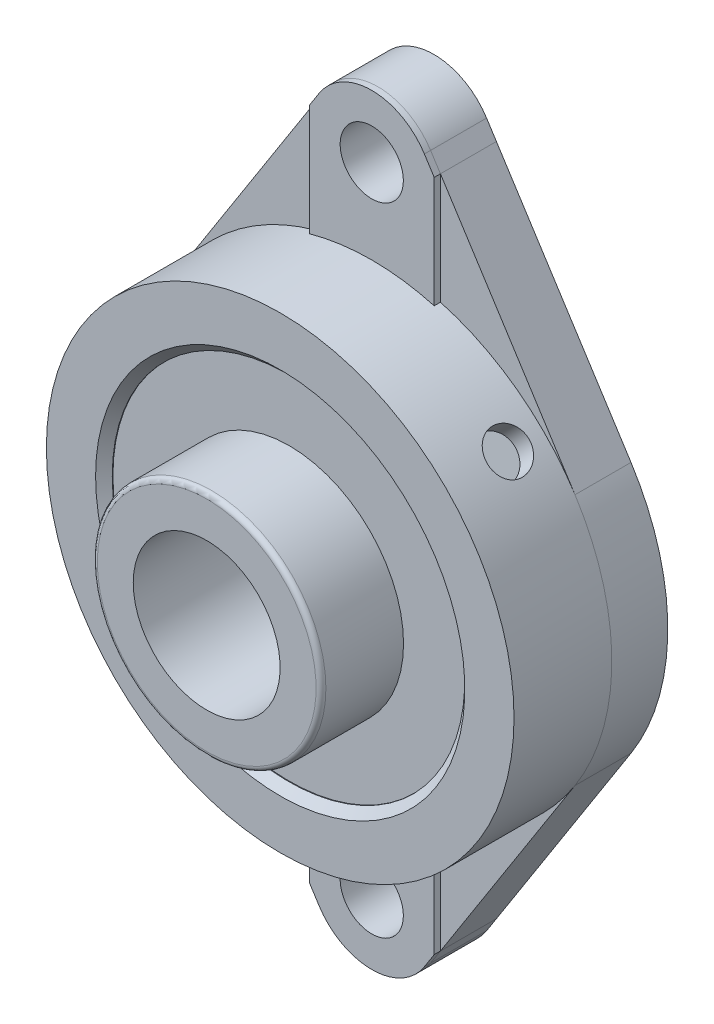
ISO-10303-21;
HEADER;
FILE_DESCRIPTION(('STEP AP214'),'2;1');
FILE_NAME('part.step','',(''),(''),'','','');
FILE_SCHEMA(('AUTOMOTIVE_DESIGN { 1 0 10303 214 1 1 1 1 }'));
ENDSEC;
DATA;
#1=APPLICATION_CONTEXT('core data for automotive mechanical design processes');
#2=APPLICATION_PROTOCOL_DEFINITION('international standard','automotive_design',2000,#1);
#3=PRODUCT_CONTEXT('',#1,'mechanical');
#4=PRODUCT('Part','Part','',(#3));
#5=PRODUCT_RELATED_PRODUCT_CATEGORY('part','',(#4));
#6=PRODUCT_DEFINITION_FORMATION('','',#4);
#7=PRODUCT_DEFINITION_CONTEXT('part definition',#1,'design');
#8=PRODUCT_DEFINITION('design','',#6,#7);
#9=PRODUCT_DEFINITION_SHAPE('','',#8);
#10=(LENGTH_UNIT() NAMED_UNIT(*) SI_UNIT(.MILLI.,.METRE.));
#11=(NAMED_UNIT(*) PLANE_ANGLE_UNIT() SI_UNIT($,.RADIAN.));
#12=(NAMED_UNIT(*) SI_UNIT($,.STERADIAN.) SOLID_ANGLE_UNIT());
#13=UNCERTAINTY_MEASURE_WITH_UNIT(LENGTH_MEASURE(1.E-05),#10,'distance_accuracy_value','');
#14=(GEOMETRIC_REPRESENTATION_CONTEXT(3) GLOBAL_UNCERTAINTY_ASSIGNED_CONTEXT((#13)) GLOBAL_UNIT_ASSIGNED_CONTEXT((#10,
#11,#12)) REPRESENTATION_CONTEXT('',''));
#15=CARTESIAN_POINT('',(0.,0.,0.));
#16=DIRECTION('',(0.,0.,1.));
#17=DIRECTION('',(1.,0.,0.));
#18=AXIS2_PLACEMENT_3D('',#15,#16,#17);
#19=CARTESIAN_POINT('',(0.,0.,0.));
#20=DIRECTION('',(0.,0.,-1.));
#21=DIRECTION('',(-1.,0.,0.));
#22=AXIS2_PLACEMENT_3D('',#19,#20,#21);
#23=CYLINDRICAL_SURFACE('',#22,36.);
#24=CARTESIAN_POINT('',(0.,0.,29.7));
#25=DIRECTION('',(0.,0.,-1.));
#26=DIRECTION('',(-1.,0.,0.));
#27=AXIS2_PLACEMENT_3D('',#24,#25,#26);
#28=CIRCLE('',#27,36.);
#29=CARTESIAN_POINT('',(-36.,0.,29.7));
#30=VERTEX_POINT('',#29);
#31=EDGE_CURVE('E313',#30,#30,#28,.T.);
#32=ORIENTED_EDGE('',*,*,#31,.F.);
#33=EDGE_LOOP('',(#32));
#34=FACE_BOUND('',#33,.T.);
#35=CARTESIAN_POINT('',(0.,0.,29.56));
#36=DIRECTION('',(0.,0.,-1.));
#37=DIRECTION('',(-1.,0.,0.));
#38=AXIS2_PLACEMENT_3D('',#35,#36,#37);
#39=CIRCLE('',#38,36.);
#40=CARTESIAN_POINT('',(-36.,0.,29.56));
#41=VERTEX_POINT('',#40);
#42=EDGE_CURVE('E11',#41,#41,#39,.F.);
#43=ORIENTED_EDGE('',*,*,#42,.F.);
#44=EDGE_LOOP('',(#43));
#45=FACE_BOUND('',#44,.T.);
#46=ADVANCED_FACE('F31',(#34,#45),#23,.F.);
#47=CARTESIAN_POINT('',(0.,0.,1.7));
#48=DIRECTION('',(0.,0.,-1.));
#49=DIRECTION('',(-1.,0.,0.));
#50=AXIS2_PLACEMENT_3D('',#47,#48,#49);
#51=CIRCLE('',#50,36.);
#52=CARTESIAN_POINT('',(-36.,0.,1.7));
#53=VERTEX_POINT('',#52);
#54=EDGE_CURVE('E202',#53,#53,#51,.T.);
#55=ORIENTED_EDGE('',*,*,#54,.T.);
#56=EDGE_LOOP('',(#55));
#57=FACE_BOUND('',#56,.T.);
#58=CARTESIAN_POINT('',(0.,0.,12.56));
#59=DIRECTION('',(0.,0.,1.));
#60=DIRECTION('',(1.,0.,0.));
#61=AXIS2_PLACEMENT_3D('',#58,#59,#60);
#62=CIRCLE('',#61,36.);
#63=CARTESIAN_POINT('',(36.,0.,12.56));
#64=VERTEX_POINT('',#63);
#65=EDGE_CURVE('E39',#64,#64,#62,.F.);
#66=ORIENTED_EDGE('',*,*,#65,.F.);
#67=EDGE_LOOP('',(#66));
#68=FACE_BOUND('',#67,.T.);
#69=ADVANCED_FACE('F291',(#57,#68),#23,.F.);
#70=CARTESIAN_POINT('',(0.,0.,0.));
#71=DIRECTION('',(0.,0.,1.));
#72=DIRECTION('',(1.,0.,0.));
#73=AXIS2_PLACEMENT_3D('',#70,#71,#72);
#74=PLANE('',#73);
#75=DIRECTION('',(0.,1.,0.));
#76=VECTOR('',#75,1.);
#77=CARTESIAN_POINT('',(12.75,0.,0.));
#78=LINE('',#77,#76);
#79=CARTESIAN_POINT('',(12.75,35.4785498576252,0.));
#80=VERTEX_POINT('',#79);
#81=CARTESIAN_POINT('',(12.75,46.0163014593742,0.));
#82=VERTEX_POINT('',#81);
#83=EDGE_CURVE('E201',#80,#82,#78,.T.);
#84=ORIENTED_EDGE('',*,*,#83,.F.);
#85=CARTESIAN_POINT('',(0.,0.,0.));
#86=DIRECTION('',(0.,0.,-1.));
#87=DIRECTION('',(-1.,0.,0.));
#88=AXIS2_PLACEMENT_3D('',#85,#86,#87);
#89=CIRCLE('',#88,37.7);
#90=CARTESIAN_POINT('',(-12.75,35.4785498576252,0.));
#91=VERTEX_POINT('',#90);
#92=EDGE_CURVE('E46',#91,#80,#89,.T.);
#93=ORIENTED_EDGE('',*,*,#92,.F.);
#94=DIRECTION('',(0.,-1.,0.));
#95=VECTOR('',#94,1.);
#96=CARTESIAN_POINT('',(-12.75,0.,0.));
#97=LINE('',#96,#95);
#98=CARTESIAN_POINT('',(-12.75,46.0163014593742,0.));
#99=VERTEX_POINT('',#98);
#100=EDGE_CURVE('E53',#99,#91,#97,.T.);
#101=ORIENTED_EDGE('',*,*,#100,.F.);
#102=CARTESIAN_POINT('',(0.,0.,0.));
#103=DIRECTION('',(0.,0.,1.));
#104=DIRECTION('',(1.,0.,0.));
#105=AXIS2_PLACEMENT_3D('',#102,#103,#104);
#106=CIRCLE('',#105,47.75);
#107=EDGE_CURVE('E528',#82,#99,#106,.T.);
#108=ORIENTED_EDGE('',*,*,#107,.F.);
#109=EDGE_LOOP('',(#84,#93,#101,#108));
#110=FACE_BOUND('',#109,.T.);
#111=ADVANCED_FACE('F200',(#110),#74,.F.);
#112=CARTESIAN_POINT('',(0.,0.,11.43));
#113=DIRECTION('',(0.,0.,1.));
#114=DIRECTION('',(1.,0.,0.));
#115=AXIS2_PLACEMENT_3D('',#112,#113,#114);
#116=PLANE('',#115);
#117=DIRECTION('',(0.,-1.,0.));
#118=VECTOR('',#117,1.);
#119=CARTESIAN_POINT('',(-12.75,0.,11.43));
#120=LINE('',#119,#118);
#121=CARTESIAN_POINT('',(-12.75,68.7258211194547,11.43));
#122=VERTEX_POINT('',#121);
#123=CARTESIAN_POINT('',(-12.75,46.0163014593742,11.43));
#124=VERTEX_POINT('',#123);
#125=EDGE_CURVE('E376',#122,#124,#120,.T.);
#126=ORIENTED_EDGE('',*,*,#125,.F.);
#127=DIRECTION('',(-0.538461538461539,-0.842650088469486,0.));
#128=VECTOR('',#127,1.);
#129=CARTESIAN_POINT('',(-10.7437886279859,71.8653846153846,11.43));
#130=LINE('',#129,#128);
#131=CARTESIAN_POINT('',(-40.236541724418,25.7115384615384,11.43));
#132=VERTEX_POINT('',#131);
#133=EDGE_CURVE('E423',#122,#132,#130,.T.);
#134=ORIENTED_EDGE('',*,*,#133,.T.);
#135=CARTESIAN_POINT('',(0.,0.,11.43));
#136=DIRECTION('',(0.,0.,1.));
#137=DIRECTION('',(1.,0.,0.));
#138=AXIS2_PLACEMENT_3D('',#135,#136,#137);
#139=CIRCLE('',#138,47.75);
#140=EDGE_CURVE('E390',#124,#132,#139,.T.);
#141=ORIENTED_EDGE('',*,*,#140,.F.);
#142=EDGE_LOOP('',(#126,#134,#141));
#143=FACE_BOUND('',#142,.T.);
#144=ADVANCED_FACE('F580',(#143),#116,.T.);
#145=CARTESIAN_POINT('',(-12.75,-35.4785498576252,0.));
#146=VERTEX_POINT('',#145);
#147=CARTESIAN_POINT('',(-12.75,-46.0163014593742,0.));
#148=VERTEX_POINT('',#147);
#149=EDGE_CURVE('E209',#146,#148,#97,.T.);
#150=ORIENTED_EDGE('',*,*,#149,.F.);
#151=CARTESIAN_POINT('',(12.75,-35.4785498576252,0.));
#152=VERTEX_POINT('',#151);
#153=EDGE_CURVE('E194',#152,#146,#89,.T.);
#154=ORIENTED_EDGE('',*,*,#153,.F.);
#155=CARTESIAN_POINT('',(12.75,-46.0163014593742,0.));
#156=VERTEX_POINT('',#155);
#157=EDGE_CURVE('E212',#156,#152,#78,.T.);
#158=ORIENTED_EDGE('',*,*,#157,.F.);
#159=EDGE_CURVE('E471',#148,#156,#106,.T.);
#160=ORIENTED_EDGE('',*,*,#159,.F.);
#161=EDGE_LOOP('',(#150,#154,#158,#160));
#162=FACE_BOUND('',#161,.T.);
#163=ADVANCED_FACE('F520',(#162),#74,.F.);
#164=ORIENTED_EDGE('',*,*,#100,.T.);
#165=EDGE_CURVE('E191',#146,#91,#89,.T.);
#166=ORIENTED_EDGE('',*,*,#165,.F.);
#167=ORIENTED_EDGE('',*,*,#149,.T.);
#168=CARTESIAN_POINT('',(-40.2365417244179,-25.7115384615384,0.));
#169=VERTEX_POINT('',#168);
#170=EDGE_CURVE('E468',#169,#148,#106,.T.);
#171=ORIENTED_EDGE('',*,*,#170,.F.);
#172=CARTESIAN_POINT('',(0.,0.,0.));
#173=DIRECTION('',(0.,0.,1.));
#174=DIRECTION('',(0.,1.,0.));
#175=AXIS2_PLACEMENT_3D('',#172,#173,#174);
#176=CIRCLE('',#175,47.75);
#177=CARTESIAN_POINT('',(-40.236541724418,25.7115384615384,0.));
#178=VERTEX_POINT('',#177);
#179=EDGE_CURVE('E392',#178,#169,#176,.T.);
#180=ORIENTED_EDGE('',*,*,#179,.F.);
#181=EDGE_CURVE('E206',#99,#178,#106,.T.);
#182=ORIENTED_EDGE('',*,*,#181,.F.);
#183=EDGE_LOOP('',(#164,#166,#167,#171,#180,#182));
#184=FACE_BOUND('',#183,.T.);
#185=ADVANCED_FACE('F204',(#184),#74,.F.);
#186=CARTESIAN_POINT('',(0.,65.,0.));
#187=DIRECTION('',(0.,0.,1.));
#188=DIRECTION('',(1.,0.,0.));
#189=AXIS2_PLACEMENT_3D('',#186,#187,#188);
#190=CIRCLE('',#189,6.45);
#191=CARTESIAN_POINT('',(6.45,65.,0.));
#192=VERTEX_POINT('',#191);
#193=EDGE_CURVE('E197',#192,#192,#190,.T.);
#194=ORIENTED_EDGE('',*,*,#193,.T.);
#195=EDGE_LOOP('',(#194));
#196=FACE_BOUND('',#195,.T.);
#197=DIRECTION('',(0.,-1.,0.));
#198=VECTOR('',#197,1.);
#199=CARTESIAN_POINT('',(-12.75,0.,0.));
#200=LINE('',#199,#198);
#201=CARTESIAN_POINT('',(-12.75,68.7258211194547,0.));
#202=VERTEX_POINT('',#201);
#203=EDGE_CURVE('E506',#202,#99,#200,.T.);
#204=ORIENTED_EDGE('',*,*,#203,.F.);
#205=DIRECTION('',(-0.538461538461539,-0.842650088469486,0.));
#206=VECTOR('',#205,1.);
#207=CARTESIAN_POINT('',(-10.7437886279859,71.8653846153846,0.));
#208=LINE('',#207,#206);
#209=CARTESIAN_POINT('',(-10.7437886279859,71.8653846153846,0.));
#210=VERTEX_POINT('',#209);
#211=EDGE_CURVE('E397',#210,#202,#208,.T.);
#212=ORIENTED_EDGE('',*,*,#211,.F.);
#213=CARTESIAN_POINT('',(0.,65.,0.));
#214=DIRECTION('',(0.,0.,1.));
#215=DIRECTION('',(0.,1.,0.));
#216=AXIS2_PLACEMENT_3D('',#213,#214,#215);
#217=CIRCLE('',#216,12.75);
#218=CARTESIAN_POINT('',(10.743788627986,71.8653846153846,0.));
#219=VERTEX_POINT('',#218);
#220=EDGE_CURVE('E400',#219,#210,#217,.T.);
#221=ORIENTED_EDGE('',*,*,#220,.F.);
#222=DIRECTION('',(0.538461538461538,-0.842650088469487,0.));
#223=VECTOR('',#222,1.);
#224=CARTESIAN_POINT('',(10.743788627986,71.8653846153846,0.));
#225=LINE('',#224,#223);
#226=CARTESIAN_POINT('',(12.75,68.7258211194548,0.));
#227=VERTEX_POINT('',#226);
#228=EDGE_CURVE('E404',#219,#227,#225,.T.);
#229=ORIENTED_EDGE('',*,*,#228,.T.);
#230=DIRECTION('',(0.,1.,0.));
#231=VECTOR('',#230,1.);
#232=CARTESIAN_POINT('',(12.75,0.,0.));
#233=LINE('',#232,#231);
#234=EDGE_CURVE('E505',#82,#227,#233,.T.);
#235=ORIENTED_EDGE('',*,*,#234,.F.);
#236=ORIENTED_EDGE('',*,*,#107,.T.);
#237=EDGE_LOOP('',(#204,#212,#221,#229,#235,#236));
#238=FACE_BOUND('',#237,.T.);
#239=ADVANCED_FACE('F594',(#196,#238),#74,.F.);
#240=EDGE_CURVE('E395',#202,#178,#208,.T.);
#241=ORIENTED_EDGE('',*,*,#240,.F.);
#242=ORIENTED_EDGE('',*,*,#203,.T.);
#243=ORIENTED_EDGE('',*,*,#181,.T.);
#244=EDGE_LOOP('',(#241,#242,#243));
#245=FACE_BOUND('',#244,.T.);
#246=ADVANCED_FACE('F533',(#245),#74,.F.);
#247=CARTESIAN_POINT('',(-10.7437886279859,-71.8653846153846,11.43));
#248=DIRECTION('',(-0.842650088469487,-0.538461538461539,0.));
#249=DIRECTION('',(0.538461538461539,-0.842650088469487,0.));
#250=AXIS2_PLACEMENT_3D('',#247,#248,#249);
#251=PLANE('',#250);
#252=DIRECTION('',(-0.538461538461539,0.842650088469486,0.));
#253=VECTOR('',#252,1.);
#254=CARTESIAN_POINT('',(-10.7437886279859,-71.8653846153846,11.43));
#255=LINE('',#254,#253);
#256=CARTESIAN_POINT('',(-10.7437886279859,-71.8653846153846,11.43));
#257=VERTEX_POINT('',#256);
#258=CARTESIAN_POINT('',(-12.75,-68.7258211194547,11.43));
#259=VERTEX_POINT('',#258);
#260=EDGE_CURVE('E424',#257,#259,#255,.T.);
#261=ORIENTED_EDGE('',*,*,#260,.T.);
#262=DIRECTION('',(0.,0.,-1.));
#263=VECTOR('',#262,1.);
#264=CARTESIAN_POINT('',(-12.75,-68.7258211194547,11.43));
#265=LINE('',#264,#263);
#266=CARTESIAN_POINT('',(-12.75,-68.7258211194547,0.));
#267=VERTEX_POINT('',#266);
#268=EDGE_CURVE('E503',#259,#267,#265,.T.);
#269=ORIENTED_EDGE('',*,*,#268,.T.);
#270=DIRECTION('',(-0.538461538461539,0.842650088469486,0.));
#271=VECTOR('',#270,1.);
#272=CARTESIAN_POINT('',(-10.7437886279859,-71.8653846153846,0.));
#273=LINE('',#272,#271);
#274=CARTESIAN_POINT('',(-10.7437886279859,-71.8653846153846,0.));
#275=VERTEX_POINT('',#274);
#276=EDGE_CURVE('E396',#275,#267,#273,.T.);
#277=ORIENTED_EDGE('',*,*,#276,.F.);
#278=DIRECTION('',(0.,0.,-1.));
#279=VECTOR('',#278,1.);
#280=CARTESIAN_POINT('',(-10.7437886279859,-71.8653846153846,11.43));
#281=LINE('',#280,#279);
#282=EDGE_CURVE('E445',#257,#275,#281,.T.);
#283=ORIENTED_EDGE('',*,*,#282,.F.);
#284=EDGE_LOOP('',(#261,#269,#277,#283));
#285=FACE_BOUND('',#284,.T.);
#286=ADVANCED_FACE('F601',(#285),#251,.T.);
#287=CARTESIAN_POINT('',(-10.7437886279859,71.8653846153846,11.43));
#288=DIRECTION('',(0.842650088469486,-0.538461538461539,0.));
#289=DIRECTION('',(0.538461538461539,0.842650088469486,0.));
#290=AXIS2_PLACEMENT_3D('',#287,#288,#289);
#291=PLANE('',#290);
#292=DIRECTION('',(0.,0.,-1.));
#293=VECTOR('',#292,1.);
#294=CARTESIAN_POINT('',(-12.75,68.7258211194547,11.43));
#295=LINE('',#294,#293);
#296=EDGE_CURVE('E500',#122,#202,#295,.T.);
#297=ORIENTED_EDGE('',*,*,#296,.F.);
#298=CARTESIAN_POINT('',(-10.7437886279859,71.8653846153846,11.43));
#299=VERTEX_POINT('',#298);
#300=EDGE_CURVE('E425',#299,#122,#130,.T.);
#301=ORIENTED_EDGE('',*,*,#300,.F.);
#302=DIRECTION('',(0.,0.,-1.));
#303=VECTOR('',#302,1.);
#304=CARTESIAN_POINT('',(-10.7437886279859,71.8653846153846,11.43));
#305=LINE('',#304,#303);
#306=EDGE_CURVE('E459',#299,#210,#305,.T.);
#307=ORIENTED_EDGE('',*,*,#306,.T.);
#308=ORIENTED_EDGE('',*,*,#211,.T.);
#309=EDGE_LOOP('',(#297,#301,#307,#308));
#310=FACE_BOUND('',#309,.T.);
#311=ADVANCED_FACE('F583',(#310),#291,.F.);
#312=CARTESIAN_POINT('',(10.743788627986,71.8653846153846,11.43));
#313=DIRECTION('',(0.842650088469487,0.538461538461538,0.));
#314=DIRECTION('',(-0.538461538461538,0.842650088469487,0.));
#315=AXIS2_PLACEMENT_3D('',#312,#313,#314);
#316=PLANE('',#315);
#317=DIRECTION('',(0.538461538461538,-0.842650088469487,0.));
#318=VECTOR('',#317,1.);
#319=CARTESIAN_POINT('',(10.743788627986,71.8653846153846,11.43));
#320=LINE('',#319,#318);
#321=CARTESIAN_POINT('',(10.743788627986,71.8653846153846,11.43));
#322=VERTEX_POINT('',#321);
#323=CARTESIAN_POINT('',(12.75,68.7258211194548,11.43));
#324=VERTEX_POINT('',#323);
#325=EDGE_CURVE('E432',#322,#324,#320,.T.);
#326=ORIENTED_EDGE('',*,*,#325,.T.);
#327=DIRECTION('',(0.,0.,-1.));
#328=VECTOR('',#327,1.);
#329=CARTESIAN_POINT('',(12.75,68.7258211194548,11.43));
#330=LINE('',#329,#328);
#331=EDGE_CURVE('E497',#324,#227,#330,.T.);
#332=ORIENTED_EDGE('',*,*,#331,.T.);
#333=ORIENTED_EDGE('',*,*,#228,.F.);
#334=DIRECTION('',(0.,0.,-1.));
#335=VECTOR('',#334,1.);
#336=CARTESIAN_POINT('',(10.743788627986,71.8653846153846,11.43));
#337=LINE('',#336,#335);
#338=EDGE_CURVE('E457',#322,#219,#337,.T.);
#339=ORIENTED_EDGE('',*,*,#338,.F.);
#340=EDGE_LOOP('',(#326,#332,#333,#339));
#341=FACE_BOUND('',#340,.T.);
#342=ADVANCED_FACE('F592',(#341),#316,.T.);
#343=CARTESIAN_POINT('',(10.743788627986,-71.8653846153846,11.43));
#344=DIRECTION('',(-0.842650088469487,0.538461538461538,0.));
#345=DIRECTION('',(-0.538461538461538,-0.842650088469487,0.));
#346=AXIS2_PLACEMENT_3D('',#343,#344,#345);
#347=PLANE('',#346);
#348=DIRECTION('',(0.,0.,-1.));
#349=VECTOR('',#348,1.);
#350=CARTESIAN_POINT('',(12.75,-68.7258211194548,11.43));
#351=LINE('',#350,#349);
#352=CARTESIAN_POINT('',(12.75,-68.7258211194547,11.43));
#353=VERTEX_POINT('',#352);
#354=CARTESIAN_POINT('',(12.75,-68.7258211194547,0.));
#355=VERTEX_POINT('',#354);
#356=EDGE_CURVE('E495',#353,#355,#351,.T.);
#357=ORIENTED_EDGE('',*,*,#356,.F.);
#358=DIRECTION('',(0.538461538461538,0.842650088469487,0.));
#359=VECTOR('',#358,1.);
#360=CARTESIAN_POINT('',(10.743788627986,-71.8653846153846,11.43));
#361=LINE('',#360,#359);
#362=CARTESIAN_POINT('',(10.743788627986,-71.8653846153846,11.43));
#363=VERTEX_POINT('',#362);
#364=EDGE_CURVE('E439',#363,#353,#361,.T.);
#365=ORIENTED_EDGE('',*,*,#364,.F.);
#366=DIRECTION('',(0.,0.,-1.));
#367=VECTOR('',#366,1.);
#368=CARTESIAN_POINT('',(10.743788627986,-71.8653846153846,11.43));
#369=LINE('',#368,#367);
#370=CARTESIAN_POINT('',(10.743788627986,-71.8653846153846,0.));
#371=VERTEX_POINT('',#370);
#372=EDGE_CURVE('E449',#363,#371,#369,.T.);
#373=ORIENTED_EDGE('',*,*,#372,.T.);
#374=DIRECTION('',(0.538461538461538,0.842650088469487,0.));
#375=VECTOR('',#374,1.);
#376=CARTESIAN_POINT('',(10.743788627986,-71.8653846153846,0.));
#377=LINE('',#376,#375);
#378=EDGE_CURVE('E411',#371,#355,#377,.T.);
#379=ORIENTED_EDGE('',*,*,#378,.T.);
#380=EDGE_LOOP('',(#357,#365,#373,#379));
#381=FACE_BOUND('',#380,.T.);
#382=ADVANCED_FACE('F612',(#381),#347,.F.);
#383=DIRECTION('',(0.,-1.,0.));
#384=VECTOR('',#383,1.);
#385=CARTESIAN_POINT('',(-12.75,0.,11.43));
#386=LINE('',#385,#384);
#387=CARTESIAN_POINT('',(-12.75,-46.0163014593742,11.43));
#388=VERTEX_POINT('',#387);
#389=EDGE_CURVE('E379',#388,#259,#386,.T.);
#390=ORIENTED_EDGE('',*,*,#389,.F.);
#391=CARTESIAN_POINT('',(-40.2365417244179,-25.7115384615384,11.43));
#392=VERTEX_POINT('',#391);
#393=EDGE_CURVE('E391',#392,#388,#139,.T.);
#394=ORIENTED_EDGE('',*,*,#393,.F.);
#395=EDGE_CURVE('E417',#259,#392,#255,.T.);
#396=ORIENTED_EDGE('',*,*,#395,.F.);
#397=EDGE_LOOP('',(#390,#394,#396));
#398=FACE_BOUND('',#397,.T.);
#399=ADVANCED_FACE('F649',(#398),#116,.T.);
#400=CARTESIAN_POINT('',(0.,-65.,0.));
#401=DIRECTION('',(0.,0.,1.));
#402=DIRECTION('',(1.,0.,0.));
#403=AXIS2_PLACEMENT_3D('',#400,#401,#402);
#404=CIRCLE('',#403,6.45);
#405=CARTESIAN_POINT('',(6.44999999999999,-65.,0.));
#406=VERTEX_POINT('',#405);
#407=EDGE_CURVE('E952',#406,#406,#404,.T.);
#408=ORIENTED_EDGE('',*,*,#407,.T.);
#409=EDGE_LOOP('',(#408));
#410=FACE_BOUND('',#409,.T.);
#411=DIRECTION('',(0.,-1.,0.));
#412=VECTOR('',#411,1.);
#413=CARTESIAN_POINT('',(-12.75,0.,0.));
#414=LINE('',#413,#412);
#415=EDGE_CURVE('E492',#148,#267,#414,.T.);
#416=ORIENTED_EDGE('',*,*,#415,.F.);
#417=ORIENTED_EDGE('',*,*,#159,.T.);
#418=DIRECTION('',(0.,1.,0.));
#419=VECTOR('',#418,1.);
#420=CARTESIAN_POINT('',(12.75,0.,0.));
#421=LINE('',#420,#419);
#422=EDGE_CURVE('E489',#355,#156,#421,.T.);
#423=ORIENTED_EDGE('',*,*,#422,.F.);
#424=ORIENTED_EDGE('',*,*,#378,.F.);
#425=CARTESIAN_POINT('',(0.,-65.,0.));
#426=DIRECTION('',(0.,0.,1.));
#427=DIRECTION('',(0.,1.,0.));
#428=AXIS2_PLACEMENT_3D('',#425,#426,#427);
#429=CIRCLE('',#428,12.75);
#430=EDGE_CURVE('E414',#275,#371,#429,.T.);
#431=ORIENTED_EDGE('',*,*,#430,.F.);
#432=ORIENTED_EDGE('',*,*,#276,.T.);
#433=EDGE_LOOP('',(#416,#417,#423,#424,#431,#432));
#434=FACE_BOUND('',#433,.T.);
#435=ADVANCED_FACE('F526',(#410,#434),#74,.F.);
#436=ORIENTED_EDGE('',*,*,#170,.T.);
#437=ORIENTED_EDGE('',*,*,#415,.T.);
#438=EDGE_CURVE('E389',#267,#169,#273,.T.);
#439=ORIENTED_EDGE('',*,*,#438,.T.);
#440=EDGE_LOOP('',(#436,#437,#439));
#441=FACE_BOUND('',#440,.T.);
#442=ADVANCED_FACE('F706',(#441),#74,.F.);
#443=DIRECTION('',(0.,1.,0.));
#444=VECTOR('',#443,1.);
#445=CARTESIAN_POINT('',(12.75,0.,11.43));
#446=LINE('',#445,#444);
#447=CARTESIAN_POINT('',(12.75,46.0163014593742,11.43));
#448=VERTEX_POINT('',#447);
#449=EDGE_CURVE('E373',#448,#324,#446,.T.);
#450=ORIENTED_EDGE('',*,*,#449,.F.);
#451=CARTESIAN_POINT('',(40.2365417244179,25.7115384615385,11.43));
#452=VERTEX_POINT('',#451);
#453=EDGE_CURVE('E386',#452,#448,#139,.T.);
#454=ORIENTED_EDGE('',*,*,#453,.F.);
#455=EDGE_CURVE('E431',#324,#452,#320,.T.);
#456=ORIENTED_EDGE('',*,*,#455,.F.);
#457=EDGE_LOOP('',(#450,#454,#456));
#458=FACE_BOUND('',#457,.T.);
#459=ADVANCED_FACE('F572',(#458),#116,.T.);
#460=ORIENTED_EDGE('',*,*,#157,.T.);
#461=CARTESIAN_POINT('',(0.,0.,0.));
#462=DIRECTION('',(0.,0.,1.));
#463=DIRECTION('',(1.,0.,0.));
#464=AXIS2_PLACEMENT_3D('',#461,#462,#463);
#465=CIRCLE('',#464,37.7);
#466=EDGE_CURVE('E208',#152,#80,#465,.T.);
#467=ORIENTED_EDGE('',*,*,#466,.T.);
#468=ORIENTED_EDGE('',*,*,#83,.T.);
#469=CARTESIAN_POINT('',(40.2365417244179,25.7115384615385,0.));
#470=VERTEX_POINT('',#469);
#471=EDGE_CURVE('E472',#470,#82,#106,.T.);
#472=ORIENTED_EDGE('',*,*,#471,.F.);
#473=CARTESIAN_POINT('',(0.,0.,0.));
#474=DIRECTION('',(0.,0.,1.));
#475=DIRECTION('',(0.,1.,0.));
#476=AXIS2_PLACEMENT_3D('',#473,#474,#475);
#477=CIRCLE('',#476,47.75);
#478=CARTESIAN_POINT('',(40.236541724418,-25.7115384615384,0.));
#479=VERTEX_POINT('',#478);
#480=EDGE_CURVE('E407',#479,#470,#477,.T.);
#481=ORIENTED_EDGE('',*,*,#480,.F.);
#482=EDGE_CURVE('E465',#156,#479,#106,.T.);
#483=ORIENTED_EDGE('',*,*,#482,.F.);
#484=EDGE_LOOP('',(#460,#467,#468,#472,#481,#483));
#485=FACE_BOUND('',#484,.T.);
#486=ADVANCED_FACE('F514',(#485),#74,.F.);
#487=ORIENTED_EDGE('',*,*,#471,.T.);
#488=ORIENTED_EDGE('',*,*,#234,.T.);
#489=EDGE_CURVE('E403',#227,#470,#225,.T.);
#490=ORIENTED_EDGE('',*,*,#489,.T.);
#491=EDGE_LOOP('',(#487,#488,#490));
#492=FACE_BOUND('',#491,.T.);
#493=ADVANCED_FACE('F287',(#492),#74,.F.);
#494=ORIENTED_EDGE('',*,*,#268,.F.);
#495=ORIENTED_EDGE('',*,*,#395,.T.);
#496=DIRECTION('',(0.,0.,-1.));
#497=VECTOR('',#496,1.);
#498=CARTESIAN_POINT('',(-40.2365417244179,-25.7115384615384,11.43));
#499=LINE('',#498,#497);
#500=EDGE_CURVE('E462',#392,#169,#499,.T.);
#501=ORIENTED_EDGE('',*,*,#500,.T.);
#502=ORIENTED_EDGE('',*,*,#438,.F.);
#503=EDGE_LOOP('',(#494,#495,#501,#502));
#504=FACE_BOUND('',#503,.T.);
#505=ADVANCED_FACE('F33',(#504),#251,.T.);
#506=CARTESIAN_POINT('',(0.,0.,11.43));
#507=DIRECTION('',(0.,0.,-1.));
#508=DIRECTION('',(-1.,0.,0.));
#509=AXIS2_PLACEMENT_3D('',#506,#507,#508);
#510=CYLINDRICAL_SURFACE('',#509,47.75);
#511=ORIENTED_EDGE('',*,*,#179,.T.);
#512=ORIENTED_EDGE('',*,*,#500,.F.);
#513=CARTESIAN_POINT('',(0.,0.,11.43));
#514=DIRECTION('',(0.,0.,1.));
#515=DIRECTION('',(0.,1.,0.));
#516=AXIS2_PLACEMENT_3D('',#513,#514,#515);
#517=CIRCLE('',#516,47.75);
#518=EDGE_CURVE('E420',#132,#392,#517,.T.);
#519=ORIENTED_EDGE('',*,*,#518,.F.);
#520=DIRECTION('',(0.,0.,-1.));
#521=VECTOR('',#520,1.);
#522=CARTESIAN_POINT('',(-40.236541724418,25.7115384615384,11.43));
#523=LINE('',#522,#521);
#524=EDGE_CURVE('E461',#132,#178,#523,.T.);
#525=ORIENTED_EDGE('',*,*,#524,.T.);
#526=EDGE_LOOP('',(#511,#512,#519,#525));
#527=FACE_BOUND('',#526,.T.);
#528=ADVANCED_FACE('F541',(#527),#510,.T.);
#529=ORIENTED_EDGE('',*,*,#133,.F.);
#530=ORIENTED_EDGE('',*,*,#296,.T.);
#531=ORIENTED_EDGE('',*,*,#240,.T.);
#532=ORIENTED_EDGE('',*,*,#524,.F.);
#533=EDGE_LOOP('',(#529,#530,#531,#532));
#534=FACE_BOUND('',#533,.T.);
#535=ADVANCED_FACE('F537',(#534),#291,.F.);
#536=CARTESIAN_POINT('',(0.,65.,11.43));
#537=DIRECTION('',(0.,0.,-1.));
#538=DIRECTION('',(-1.,0.,0.));
#539=AXIS2_PLACEMENT_3D('',#536,#537,#538);
#540=CYLINDRICAL_SURFACE('',#539,12.75);
#541=ORIENTED_EDGE('',*,*,#220,.T.);
#542=ORIENTED_EDGE('',*,*,#306,.F.);
#543=CARTESIAN_POINT('',(0.,65.,11.43));
#544=DIRECTION('',(0.,0.,1.));
#545=DIRECTION('',(0.,1.,0.));
#546=AXIS2_PLACEMENT_3D('',#543,#544,#545);
#547=CIRCLE('',#546,12.75);
#548=EDGE_CURVE('E428',#322,#299,#547,.T.);
#549=ORIENTED_EDGE('',*,*,#548,.F.);
#550=ORIENTED_EDGE('',*,*,#338,.T.);
#551=EDGE_LOOP('',(#541,#542,#549,#550));
#552=FACE_BOUND('',#551,.T.);
#553=ADVANCED_FACE('F589',(#552),#540,.T.);
#554=ORIENTED_EDGE('',*,*,#331,.F.);
#555=ORIENTED_EDGE('',*,*,#455,.T.);
#556=DIRECTION('',(0.,0.,-1.));
#557=VECTOR('',#556,1.);
#558=CARTESIAN_POINT('',(40.2365417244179,25.7115384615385,11.43));
#559=LINE('',#558,#557);
#560=EDGE_CURVE('E454',#452,#470,#559,.T.);
#561=ORIENTED_EDGE('',*,*,#560,.T.);
#562=ORIENTED_EDGE('',*,*,#489,.F.);
#563=EDGE_LOOP('',(#554,#555,#561,#562));
#564=FACE_BOUND('',#563,.T.);
#565=ADVANCED_FACE('F615',(#564),#316,.T.);
#566=CARTESIAN_POINT('',(0.,0.,11.43));
#567=DIRECTION('',(0.,0.,-1.));
#568=DIRECTION('',(-1.,0.,0.));
#569=AXIS2_PLACEMENT_3D('',#566,#567,#568);
#570=CYLINDRICAL_SURFACE('',#569,47.75);
#571=ORIENTED_EDGE('',*,*,#480,.T.);
#572=ORIENTED_EDGE('',*,*,#560,.F.);
#573=CARTESIAN_POINT('',(0.,0.,11.43));
#574=DIRECTION('',(0.,0.,1.));
#575=DIRECTION('',(0.,1.,0.));
#576=AXIS2_PLACEMENT_3D('',#573,#574,#575);
#577=CIRCLE('',#576,47.75);
#578=CARTESIAN_POINT('',(40.236541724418,-25.7115384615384,11.43));
#579=VERTEX_POINT('',#578);
#580=EDGE_CURVE('E435',#579,#452,#577,.T.);
#581=ORIENTED_EDGE('',*,*,#580,.F.);
#582=DIRECTION('',(0.,0.,-1.));
#583=VECTOR('',#582,1.);
#584=CARTESIAN_POINT('',(40.236541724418,-25.7115384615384,11.43));
#585=LINE('',#584,#583);
#586=EDGE_CURVE('E451',#579,#479,#585,.T.);
#587=ORIENTED_EDGE('',*,*,#586,.T.);
#588=EDGE_LOOP('',(#571,#572,#581,#587));
#589=FACE_BOUND('',#588,.T.);
#590=ADVANCED_FACE('F566',(#589),#570,.T.);
#591=EDGE_CURVE('E438',#353,#579,#361,.T.);
#592=ORIENTED_EDGE('',*,*,#591,.F.);
#593=ORIENTED_EDGE('',*,*,#356,.T.);
#594=EDGE_CURVE('E410',#355,#479,#377,.T.);
#595=ORIENTED_EDGE('',*,*,#594,.T.);
#596=ORIENTED_EDGE('',*,*,#586,.F.);
#597=EDGE_LOOP('',(#592,#593,#595,#596));
#598=FACE_BOUND('',#597,.T.);
#599=ADVANCED_FACE('F563',(#598),#347,.F.);
#600=CARTESIAN_POINT('',(0.,-65.,11.43));
#601=DIRECTION('',(0.,0.,-1.));
#602=DIRECTION('',(-1.,0.,0.));
#603=AXIS2_PLACEMENT_3D('',#600,#601,#602);
#604=CYLINDRICAL_SURFACE('',#603,12.75);
#605=ORIENTED_EDGE('',*,*,#430,.T.);
#606=ORIENTED_EDGE('',*,*,#372,.F.);
#607=CARTESIAN_POINT('',(0.,-65.,11.43));
#608=DIRECTION('',(0.,0.,1.));
#609=DIRECTION('',(0.,1.,0.));
#610=AXIS2_PLACEMENT_3D('',#607,#608,#609);
#611=CIRCLE('',#610,12.75);
#612=EDGE_CURVE('E442',#257,#363,#611,.T.);
#613=ORIENTED_EDGE('',*,*,#612,.F.);
#614=ORIENTED_EDGE('',*,*,#282,.T.);
#615=EDGE_LOOP('',(#605,#606,#613,#614));
#616=FACE_BOUND('',#615,.T.);
#617=ADVANCED_FACE('F606',(#616),#604,.T.);
#618=DIRECTION('',(0.,1.,0.));
#619=VECTOR('',#618,1.);
#620=CARTESIAN_POINT('',(12.75,0.,11.43));
#621=LINE('',#620,#619);
#622=CARTESIAN_POINT('',(12.75,-46.0163014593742,11.43));
#623=VERTEX_POINT('',#622);
#624=EDGE_CURVE('E370',#353,#623,#621,.T.);
#625=ORIENTED_EDGE('',*,*,#624,.F.);
#626=ORIENTED_EDGE('',*,*,#591,.T.);
#627=EDGE_CURVE('E385',#623,#579,#139,.T.);
#628=ORIENTED_EDGE('',*,*,#627,.F.);
#629=EDGE_LOOP('',(#625,#626,#628));
#630=FACE_BOUND('',#629,.T.);
#631=ADVANCED_FACE('F285',(#630),#116,.T.);
#632=ORIENTED_EDGE('',*,*,#594,.F.);
#633=ORIENTED_EDGE('',*,*,#422,.T.);
#634=ORIENTED_EDGE('',*,*,#482,.T.);
#635=EDGE_LOOP('',(#632,#633,#634));
#636=FACE_BOUND('',#635,.T.);
#637=ADVANCED_FACE('F278',(#636),#74,.F.);
#638=CARTESIAN_POINT('',(0.,0.,31.4));
#639=DIRECTION('',(0.,0.,1.));
#640=DIRECTION('',(1.,0.,0.));
#641=AXIS2_PLACEMENT_3D('',#638,#639,#640);
#642=PLANE('',#641);
#643=CARTESIAN_POINT('',(0.,0.,31.4));
#644=DIRECTION('',(0.,0.,-1.));
#645=DIRECTION('',(-1.,0.,0.));
#646=AXIS2_PLACEMENT_3D('',#643,#644,#645);
#647=CIRCLE('',#646,37.7);
#648=CARTESIAN_POINT('',(-37.7,0.,31.4));
#649=VERTEX_POINT('',#648);
#650=EDGE_CURVE('E311',#649,#649,#647,.T.);
#651=ORIENTED_EDGE('',*,*,#650,.T.);
#652=EDGE_LOOP('',(#651));
#653=FACE_BOUND('',#652,.T.);
#654=CARTESIAN_POINT('',(0.,0.,31.4));
#655=DIRECTION('',(0.,0.,-1.));
#656=DIRECTION('',(0.,1.,0.));
#657=AXIS2_PLACEMENT_3D('',#654,#655,#656);
#658=CIRCLE('',#657,47.75);
#659=CARTESIAN_POINT('',(0.,47.75,31.4));
#660=VERTEX_POINT('',#659);
#661=EDGE_CURVE('E382',#660,#660,#658,.T.);
#662=ORIENTED_EDGE('',*,*,#661,.F.);
#663=EDGE_LOOP('',(#662));
#664=FACE_BOUND('',#663,.T.);
#665=ADVANCED_FACE('F276',(#653,#664),#642,.T.);
#666=CARTESIAN_POINT('',(0.,0.,0.));
#667=DIRECTION('',(0.,0.,1.));
#668=DIRECTION('',(0.,1.,0.));
#669=AXIS2_PLACEMENT_3D('',#666,#667,#668);
#670=CYLINDRICAL_SURFACE('',#669,47.75);
#671=CARTESIAN_POINT('',(36.6567884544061,30.5997117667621,18.6236));
#672=CARTESIAN_POINT('',(36.6567828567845,30.5997209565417,18.3835417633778));
#673=CARTESIAN_POINT('',(36.6437682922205,30.6153301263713,18.1433217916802));
#674=CARTESIAN_POINT('',(36.5919369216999,30.6772589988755,17.6695333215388));
#675=CARTESIAN_POINT('',(36.5530911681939,30.7236131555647,17.4359725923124));
#676=CARTESIAN_POINT('',(36.450413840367,30.8453583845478,16.9824329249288));
#677=CARTESIAN_POINT('',(36.3865967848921,30.9207325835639,16.7624461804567));
#678=CARTESIAN_POINT('',(36.2353286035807,31.0978610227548,16.3421660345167));
#679=CARTESIAN_POINT('',(36.1478824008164,31.199609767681,16.1418685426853));
#680=CARTESIAN_POINT('',(35.9509580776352,31.4263209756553,15.7660106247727));
#681=CARTESIAN_POINT('',(35.8414228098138,31.5513435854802,15.5905164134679));
#682=CARTESIAN_POINT('',(35.602887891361,31.8202625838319,15.2698160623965));
#683=CARTESIAN_POINT('',(35.4738873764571,31.9641598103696,15.1246112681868));
#684=CARTESIAN_POINT('',(35.199188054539,32.2664124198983,14.8683877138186));
#685=CARTESIAN_POINT('',(35.0534615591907,32.4247916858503,14.7574267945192));
#686=CARTESIAN_POINT('',(34.7490770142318,32.7507835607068,14.5732107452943));
#687=CARTESIAN_POINT('',(34.5904192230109,32.9183959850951,14.4999548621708));
#688=CARTESIAN_POINT('',(34.2647569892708,33.2572393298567,14.3934204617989));
#689=CARTESIAN_POINT('',(34.0977763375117,33.428459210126,14.3600341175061));
#690=CARTESIAN_POINT('',(33.759659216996,33.7698922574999,14.3338530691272));
#691=CARTESIAN_POINT('',(33.5885228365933,33.9401054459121,14.3410575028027));
#692=CARTESIAN_POINT('',(33.2475135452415,34.2742203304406,14.3957655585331));
#693=CARTESIAN_POINT('',(33.0776384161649,34.4381387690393,14.4431532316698));
#694=CARTESIAN_POINT('',(32.7437099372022,34.7557923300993,14.5767021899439));
#695=CARTESIAN_POINT('',(32.5796566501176,34.9095273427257,14.6628638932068));
#696=CARTESIAN_POINT('',(32.2621900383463,35.2031314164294,14.8716435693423));
#697=CARTESIAN_POINT('',(32.1087921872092,35.3429804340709,14.9943132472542));
#698=CARTESIAN_POINT('',(31.8177532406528,35.6052174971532,15.2725891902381));
#699=CARTESIAN_POINT('',(31.6801125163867,35.7276051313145,15.4281962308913));
#700=CARTESIAN_POINT('',(31.4246237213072,35.9525334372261,15.7685827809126));
#701=CARTESIAN_POINT('',(31.3068470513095,36.0550027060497,15.9534630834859));
#702=CARTESIAN_POINT('',(31.0956539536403,36.237305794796,16.3467974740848));
#703=CARTESIAN_POINT('',(31.0022375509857,36.3171395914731,16.5552515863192));
#704=CARTESIAN_POINT('',(30.8429937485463,36.4524788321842,16.9898896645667));
#705=CARTESIAN_POINT('',(30.7771705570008,36.5079805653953,17.2160763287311));
#706=CARTESIAN_POINT('',(30.6754786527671,36.5934688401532,17.6797234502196));
#707=CARTESIAN_POINT('',(30.6396092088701,36.623456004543,17.9171836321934));
#708=CARTESIAN_POINT('',(30.5991924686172,36.6572315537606,18.3957525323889));
#709=CARTESIAN_POINT('',(30.5945366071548,36.6611107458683,18.6368456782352));
#710=CARTESIAN_POINT('',(30.6164273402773,36.6428311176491,19.1166137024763));
#711=CARTESIAN_POINT('',(30.6429735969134,36.6206725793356,19.3552886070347));
#712=CARTESIAN_POINT('',(30.726238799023,36.5508366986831,19.8230380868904));
#713=CARTESIAN_POINT('',(30.7829070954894,36.5032021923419,20.0521280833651));
#714=CARTESIAN_POINT('',(30.9243762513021,36.3834302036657,20.4946830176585));
#715=CARTESIAN_POINT('',(31.0091776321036,36.3112922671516,20.708147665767));
#716=CARTESIAN_POINT('',(31.2042449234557,36.1437976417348,21.1140366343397));
#717=CARTESIAN_POINT('',(31.3145801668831,36.0483776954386,21.3064015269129));
#718=CARTESIAN_POINT('',(31.5568489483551,35.8364844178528,21.6640290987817));
#719=CARTESIAN_POINT('',(31.6887829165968,35.7200106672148,21.8292912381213));
#720=CARTESIAN_POINT('',(31.9703104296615,35.4682596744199,22.1285051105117));
#721=CARTESIAN_POINT('',(32.1199538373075,35.3329291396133,22.2623651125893));
#722=CARTESIAN_POINT('',(32.4317682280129,35.0469343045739,22.4943448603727));
#723=CARTESIAN_POINT('',(32.5939390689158,34.8962701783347,22.5924650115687));
#724=CARTESIAN_POINT('',(32.9254818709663,34.5836224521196,22.7500230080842));
#725=CARTESIAN_POINT('',(33.0948429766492,34.4216556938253,22.8095171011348));
#726=CARTESIAN_POINT('',(33.4358483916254,34.0905118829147,22.8883179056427));
#727=CARTESIAN_POINT('',(33.6074926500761,33.9213349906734,22.9076255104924));
#728=CARTESIAN_POINT('',(33.9474495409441,33.5811078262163,22.905494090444));
#729=CARTESIAN_POINT('',(34.1157717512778,33.4100662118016,22.8841978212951));
#730=CARTESIAN_POINT('',(34.4450347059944,33.0705010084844,22.8017614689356));
#731=CARTESIAN_POINT('',(34.6059754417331,32.9019774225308,22.7406213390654));
#732=CARTESIAN_POINT('',(34.9162283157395,32.5725457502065,22.5802703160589));
#733=CARTESIAN_POINT('',(35.0655414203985,32.4116370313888,22.4810625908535));
#734=CARTESIAN_POINT('',(35.3488471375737,32.1024225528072,22.2474083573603));
#735=CARTESIAN_POINT('',(35.4828399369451,31.9541166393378,22.1129622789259));
#736=CARTESIAN_POINT('',(35.7327880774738,31.6743701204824,21.8121116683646));
#737=CARTESIAN_POINT('',(35.8486812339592,31.5429879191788,21.645601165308));
#738=CARTESIAN_POINT('',(36.0593070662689,31.3019897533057,21.2855477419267));
#739=CARTESIAN_POINT('',(36.154034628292,31.1923790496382,21.0919983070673));
#740=CARTESIAN_POINT('',(36.3204166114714,30.9984877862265,20.6829276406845));
#741=CARTESIAN_POINT('',(36.3920218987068,30.914261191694,20.4673608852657));
#742=CARTESIAN_POINT('',(36.5103031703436,30.7744816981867,20.0208487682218));
#743=CARTESIAN_POINT('',(36.5570076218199,30.7188960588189,19.7899213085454));
#744=CARTESIAN_POINT('',(36.6127439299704,30.6524154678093,19.4019756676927));
#745=CARTESIAN_POINT('',(36.6292438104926,30.632683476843,19.2474474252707));
#746=CARTESIAN_POINT('',(36.6512678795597,30.6063286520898,18.9365023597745));
#747=CARTESIAN_POINT('',(36.6567921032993,30.5997057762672,18.7800855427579));
#748=CARTESIAN_POINT('',(36.6567884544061,30.5997117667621,18.6236));
#749=B_SPLINE_CURVE_WITH_KNOTS('',3,(#671,#672,#673,#674,#675,#676,#677,#678,#679,#680,#681,
#682,#683,#684,#685,#686,#687,#688,#689,#690,#691,#692,#693,#694,#695,#696,#697,#698,#699,#700,
#701,#702,#703,#704,#705,#706,#707,#708,#709,#710,#711,#712,#713,#714,#715,#716,#717,#718,#719,
#720,#721,#722,#723,#724,#725,#726,#727,#728,#729,#730,#731,#732,#733,#734,#735,#736,#737,#738,
#739,#740,#741,#742,#743,#744,#745,#746,#747,#748),.UNSPECIFIED.,.T.,.F.,(4,2,2,2,2,2,2,2,2,2,2,
2,2,2,2,2,2,2,2,2,2,2,2,2,2,2,2,2,2,2,2,2,2,2,2,2,2,2,4),(0.,0.719603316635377,1.440014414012,
2.1600072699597,2.87985023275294,3.60157998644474,4.3233417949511,5.04631613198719,
5.76927602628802,6.49027621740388,7.21126109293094,7.93017261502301,8.64909188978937,
9.36903423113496,10.0889935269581,10.8114879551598,11.5339831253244,12.2565884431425,
12.9791761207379,13.6992492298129,14.4193145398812,15.1381729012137,15.8570445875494,
16.5778916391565,17.2987530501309,18.0216947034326,18.7446281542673,19.4665064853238,
20.1883687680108,20.9076977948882,21.6270276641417,22.3462976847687,23.0655589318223,
23.7872394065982,24.5090940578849,25.2324726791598,25.9550225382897,26.424108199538,
26.8931923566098),.UNSPECIFIED.);
#750=CARTESIAN_POINT('',(36.6567884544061,30.5997117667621,18.6236));
#751=VERTEX_POINT('',#750);
#752=EDGE_CURVE('E216',#751,#751,#749,.T.);
#753=ORIENTED_EDGE('',*,*,#752,.F.);
#754=EDGE_LOOP('',(#753));
#755=FACE_BOUND('',#754,.T.);
#756=DIRECTION('',(0.,0.,1.));
#757=VECTOR('',#756,1.);
#758=CARTESIAN_POINT('',(-12.75,-46.0163014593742,0.));
#759=LINE('',#758,#757);
#760=CARTESIAN_POINT('',(-12.75,-46.0163014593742,12.7));
#761=VERTEX_POINT('',#760);
#762=EDGE_CURVE('E486',#761,#388,#759,.F.);
#763=ORIENTED_EDGE('',*,*,#762,.F.);
#764=CARTESIAN_POINT('',(0.,0.,12.7));
#765=DIRECTION('',(0.,0.,1.));
#766=DIRECTION('',(1.,0.,0.));
#767=AXIS2_PLACEMENT_3D('',#764,#765,#766);
#768=CIRCLE('',#767,47.75);
#769=CARTESIAN_POINT('',(12.75,-46.0163014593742,12.7));
#770=VERTEX_POINT('',#769);
#771=EDGE_CURVE('E477',#770,#761,#768,.F.);
#772=ORIENTED_EDGE('',*,*,#771,.F.);
#773=DIRECTION('',(0.,0.,1.));
#774=VECTOR('',#773,1.);
#775=CARTESIAN_POINT('',(12.75,-46.0163014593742,0.));
#776=LINE('',#775,#774);
#777=EDGE_CURVE('E483',#623,#770,#776,.T.);
#778=ORIENTED_EDGE('',*,*,#777,.F.);
#779=ORIENTED_EDGE('',*,*,#627,.T.);
#780=ORIENTED_EDGE('',*,*,#580,.T.);
#781=ORIENTED_EDGE('',*,*,#453,.T.);
#782=DIRECTION('',(0.,0.,1.));
#783=VECTOR('',#782,1.);
#784=CARTESIAN_POINT('',(12.75,46.0163014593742,0.));
#785=LINE('',#784,#783);
#786=CARTESIAN_POINT('',(12.75,46.0163014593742,12.7));
#787=VERTEX_POINT('',#786);
#788=EDGE_CURVE('E476',#787,#448,#785,.F.);
#789=ORIENTED_EDGE('',*,*,#788,.F.);
#790=CARTESIAN_POINT('',(-12.75,46.0163014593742,12.7));
#791=VERTEX_POINT('',#790);
#792=EDGE_CURVE('E473',#791,#787,#768,.F.);
#793=ORIENTED_EDGE('',*,*,#792,.F.);
#794=DIRECTION('',(0.,0.,1.));
#795=VECTOR('',#794,1.);
#796=CARTESIAN_POINT('',(-12.75,46.0163014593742,0.));
#797=LINE('',#796,#795);
#798=EDGE_CURVE('E480',#124,#791,#797,.T.);
#799=ORIENTED_EDGE('',*,*,#798,.F.);
#800=ORIENTED_EDGE('',*,*,#140,.T.);
#801=ORIENTED_EDGE('',*,*,#518,.T.);
#802=ORIENTED_EDGE('',*,*,#393,.T.);
#803=EDGE_LOOP('',(#763,#772,#778,#779,#780,#781,#789,#793,#799,#800,#801,#802));
#804=FACE_BOUND('',#803,.T.);
#805=ORIENTED_EDGE('',*,*,#661,.T.);
#806=EDGE_LOOP('',(#805));
#807=FACE_BOUND('',#806,.T.);
#808=ADVANCED_FACE('F225',(#755,#804,#807),#670,.T.);
#809=CARTESIAN_POINT('',(0.,65.,12.7));
#810=DIRECTION('',(0.,0.,1.));
#811=DIRECTION('',(1.,0.,0.));
#812=AXIS2_PLACEMENT_3D('',#809,#810,#811);
#813=PLANE('',#812);
#814=CARTESIAN_POINT('',(0.,65.,12.7));
#815=DIRECTION('',(0.,0.,1.));
#816=DIRECTION('',(1.,0.,0.));
#817=AXIS2_PLACEMENT_3D('',#814,#815,#816);
#818=CIRCLE('',#817,6.45);
#819=CARTESIAN_POINT('',(6.45,65.,12.7));
#820=VERTEX_POINT('',#819);
#821=EDGE_CURVE('E955',#820,#820,#818,.T.);
#822=ORIENTED_EDGE('',*,*,#821,.F.);
#823=EDGE_LOOP('',(#822));
#824=FACE_BOUND('',#823,.T.);
#825=DIRECTION('',(0.,1.,0.));
#826=VECTOR('',#825,1.);
#827=CARTESIAN_POINT('',(-12.75,-68.7258211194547,12.7));
#828=LINE('',#827,#826);
#829=CARTESIAN_POINT('',(-12.75,68.7258211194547,12.7));
#830=VERTEX_POINT('',#829);
#831=EDGE_CURVE('E222',#791,#830,#828,.T.);
#832=ORIENTED_EDGE('',*,*,#831,.F.);
#833=ORIENTED_EDGE('',*,*,#792,.T.);
#834=DIRECTION('',(0.,-1.,0.));
#835=VECTOR('',#834,1.);
#836=CARTESIAN_POINT('',(12.75,68.7258211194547,12.7));
#837=LINE('',#836,#835);
#838=CARTESIAN_POINT('',(12.75,68.7258211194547,12.7));
#839=VERTEX_POINT('',#838);
#840=EDGE_CURVE('E332',#839,#787,#837,.T.);
#841=ORIENTED_EDGE('',*,*,#840,.F.);
#842=DIRECTION('',(0.538461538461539,-0.842650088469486,0.));
#843=VECTOR('',#842,1.);
#844=CARTESIAN_POINT('',(10.7437886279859,71.8653846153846,12.7));
#845=LINE('',#844,#843);
#846=CARTESIAN_POINT('',(10.7437886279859,71.8653846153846,12.7));
#847=VERTEX_POINT('',#846);
#848=EDGE_CURVE('E328',#847,#839,#845,.T.);
#849=ORIENTED_EDGE('',*,*,#848,.F.);
#850=CARTESIAN_POINT('',(0.,65.,12.7));
#851=DIRECTION('',(0.,0.,1.));
#852=DIRECTION('',(0.,1.,0.));
#853=AXIS2_PLACEMENT_3D('',#850,#851,#852);
#854=CIRCLE('',#853,12.75);
#855=CARTESIAN_POINT('',(-10.7437886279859,71.8653846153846,12.7));
#856=VERTEX_POINT('',#855);
#857=EDGE_CURVE('E324',#847,#856,#854,.T.);
#858=ORIENTED_EDGE('',*,*,#857,.T.);
#859=DIRECTION('',(0.538461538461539,0.842650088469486,0.));
#860=VECTOR('',#859,1.);
#861=CARTESIAN_POINT('',(-12.75,68.7258211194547,12.7));
#862=LINE('',#861,#860);
#863=EDGE_CURVE('E321',#830,#856,#862,.T.);
#864=ORIENTED_EDGE('',*,*,#863,.F.);
#865=EDGE_LOOP('',(#832,#833,#841,#849,#858,#864));
#866=FACE_BOUND('',#865,.T.);
#867=ADVANCED_FACE('F238',(#824,#866),#813,.T.);
#868=CARTESIAN_POINT('',(12.75,68.7258211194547,12.7));
#869=DIRECTION('',(1.,0.,0.));
#870=DIRECTION('',(0.,0.,-1.));
#871=AXIS2_PLACEMENT_3D('',#868,#869,#870);
#872=PLANE('',#871);
#873=ORIENTED_EDGE('',*,*,#788,.T.);
#874=ORIENTED_EDGE('',*,*,#449,.T.);
#875=DIRECTION('',(0.,0.,-1.));
#876=VECTOR('',#875,1.);
#877=CARTESIAN_POINT('',(12.75,68.7258211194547,12.7));
#878=LINE('',#877,#876);
#879=EDGE_CURVE('E358',#839,#324,#878,.T.);
#880=ORIENTED_EDGE('',*,*,#879,.F.);
#881=ORIENTED_EDGE('',*,*,#840,.T.);
#882=EDGE_LOOP('',(#873,#874,#880,#881));
#883=FACE_BOUND('',#882,.T.);
#884=ADVANCED_FACE('F241',(#883),#872,.T.);
#885=CARTESIAN_POINT('',(-12.75,-68.7258211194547,12.7));
#886=DIRECTION('',(-1.,0.,0.));
#887=DIRECTION('',(0.,0.,1.));
#888=AXIS2_PLACEMENT_3D('',#885,#886,#887);
#889=PLANE('',#888);
#890=DIRECTION('',(0.,0.,-1.));
#891=VECTOR('',#890,1.);
#892=CARTESIAN_POINT('',(-12.75,68.7258211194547,12.7));
#893=LINE('',#892,#891);
#894=EDGE_CURVE('E367',#830,#122,#893,.T.);
#895=ORIENTED_EDGE('',*,*,#894,.T.);
#896=ORIENTED_EDGE('',*,*,#125,.T.);
#897=ORIENTED_EDGE('',*,*,#798,.T.);
#898=ORIENTED_EDGE('',*,*,#831,.T.);
#899=EDGE_LOOP('',(#895,#896,#897,#898));
#900=FACE_BOUND('',#899,.T.);
#901=ADVANCED_FACE('F264',(#900),#889,.T.);
#902=CARTESIAN_POINT('',(10.7437886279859,71.8653846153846,12.7));
#903=DIRECTION('',(0.842650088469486,0.538461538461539,0.));
#904=DIRECTION('',(-0.538461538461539,0.842650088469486,0.));
#905=AXIS2_PLACEMENT_3D('',#902,#903,#904);
#906=PLANE('',#905);
#907=ORIENTED_EDGE('',*,*,#879,.T.);
#908=ORIENTED_EDGE('',*,*,#325,.F.);
#909=DIRECTION('',(0.,0.,-1.));
#910=VECTOR('',#909,1.);
#911=CARTESIAN_POINT('',(10.7437886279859,71.8653846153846,12.7));
#912=LINE('',#911,#910);
#913=EDGE_CURVE('E361',#847,#322,#912,.T.);
#914=ORIENTED_EDGE('',*,*,#913,.F.);
#915=ORIENTED_EDGE('',*,*,#848,.T.);
#916=EDGE_LOOP('',(#907,#908,#914,#915));
#917=FACE_BOUND('',#916,.T.);
#918=ADVANCED_FACE('F260',(#917),#906,.T.);
#919=CARTESIAN_POINT('',(0.,65.,12.7));
#920=DIRECTION('',(0.,0.,-1.));
#921=DIRECTION('',(-1.,0.,0.));
#922=AXIS2_PLACEMENT_3D('',#919,#920,#921);
#923=CYLINDRICAL_SURFACE('',#922,12.75);
#924=ORIENTED_EDGE('',*,*,#548,.T.);
#925=DIRECTION('',(0.,0.,-1.));
#926=VECTOR('',#925,1.);
#927=CARTESIAN_POINT('',(-10.7437886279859,71.8653846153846,12.7));
#928=LINE('',#927,#926);
#929=EDGE_CURVE('E364',#856,#299,#928,.T.);
#930=ORIENTED_EDGE('',*,*,#929,.F.);
#931=ORIENTED_EDGE('',*,*,#857,.F.);
#932=ORIENTED_EDGE('',*,*,#913,.T.);
#933=EDGE_LOOP('',(#924,#930,#931,#932));
#934=FACE_BOUND('',#933,.T.);
#935=ADVANCED_FACE('F263',(#934),#923,.T.);
#936=CARTESIAN_POINT('',(-12.75,68.7258211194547,12.7));
#937=DIRECTION('',(-0.842650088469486,0.538461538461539,0.));
#938=DIRECTION('',(-0.538461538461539,-0.842650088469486,0.));
#939=AXIS2_PLACEMENT_3D('',#936,#937,#938);
#940=PLANE('',#939);
#941=ORIENTED_EDGE('',*,*,#929,.T.);
#942=ORIENTED_EDGE('',*,*,#300,.T.);
#943=ORIENTED_EDGE('',*,*,#894,.F.);
#944=ORIENTED_EDGE('',*,*,#863,.T.);
#945=EDGE_LOOP('',(#941,#942,#943,#944));
#946=FACE_BOUND('',#945,.T.);
#947=ADVANCED_FACE('F268',(#946),#940,.T.);
#948=ORIENTED_EDGE('',*,*,#762,.T.);
#949=ORIENTED_EDGE('',*,*,#389,.T.);
#950=DIRECTION('',(0.,0.,-1.));
#951=VECTOR('',#950,1.);
#952=CARTESIAN_POINT('',(-12.75,-68.7258211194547,12.7));
#953=LINE('',#952,#951);
#954=CARTESIAN_POINT('',(-12.75,-68.7258211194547,12.7));
#955=VERTEX_POINT('',#954);
#956=EDGE_CURVE('E344',#955,#259,#953,.T.);
#957=ORIENTED_EDGE('',*,*,#956,.F.);
#958=EDGE_CURVE('E325',#955,#761,#828,.T.);
#959=ORIENTED_EDGE('',*,*,#958,.T.);
#960=EDGE_LOOP('',(#948,#949,#957,#959));
#961=FACE_BOUND('',#960,.T.);
#962=ADVANCED_FACE('F272',(#961),#889,.T.);
#963=CARTESIAN_POINT('',(0.,-65.,12.7));
#964=DIRECTION('',(0.,0.,1.));
#965=DIRECTION('',(1.,0.,0.));
#966=AXIS2_PLACEMENT_3D('',#963,#964,#965);
#967=CIRCLE('',#966,6.45);
#968=CARTESIAN_POINT('',(6.44999999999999,-65.,12.7));
#969=VERTEX_POINT('',#968);
#970=EDGE_CURVE('E951',#969,#969,#967,.T.);
#971=ORIENTED_EDGE('',*,*,#970,.F.);
#972=EDGE_LOOP('',(#971));
#973=FACE_BOUND('',#972,.T.);
#974=CARTESIAN_POINT('',(12.75,-68.7258211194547,12.7));
#975=VERTEX_POINT('',#974);
#976=EDGE_CURVE('E331',#770,#975,#837,.T.);
#977=ORIENTED_EDGE('',*,*,#976,.F.);
#978=ORIENTED_EDGE('',*,*,#771,.T.);
#979=ORIENTED_EDGE('',*,*,#958,.F.);
#980=DIRECTION('',(-0.538461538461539,0.842650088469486,0.));
#981=VECTOR('',#980,1.);
#982=CARTESIAN_POINT('',(-10.7437886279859,-71.8653846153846,12.7));
#983=LINE('',#982,#981);
#984=CARTESIAN_POINT('',(-10.7437886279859,-71.8653846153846,12.7));
#985=VERTEX_POINT('',#984);
#986=EDGE_CURVE('E341',#985,#955,#983,.T.);
#987=ORIENTED_EDGE('',*,*,#986,.F.);
#988=CARTESIAN_POINT('',(0.,-65.,12.7));
#989=DIRECTION('',(0.,0.,1.));
#990=DIRECTION('',(0.,1.,0.));
#991=AXIS2_PLACEMENT_3D('',#988,#989,#990);
#992=CIRCLE('',#991,12.75);
#993=CARTESIAN_POINT('',(10.7437886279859,-71.8653846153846,12.7));
#994=VERTEX_POINT('',#993);
#995=EDGE_CURVE('E338',#985,#994,#992,.T.);
#996=ORIENTED_EDGE('',*,*,#995,.T.);
#997=DIRECTION('',(-0.538461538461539,-0.842650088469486,0.));
#998=VECTOR('',#997,1.);
#999=CARTESIAN_POINT('',(12.75,-68.7258211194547,12.7));
#1000=LINE('',#999,#998);
#1001=EDGE_CURVE('E335',#975,#994,#1000,.T.);
#1002=ORIENTED_EDGE('',*,*,#1001,.F.);
#1003=EDGE_LOOP('',(#977,#978,#979,#987,#996,#1002));
#1004=FACE_BOUND('',#1003,.T.);
#1005=ADVANCED_FACE('F243',(#973,#1004),#813,.T.);
#1006=DIRECTION('',(0.,0.,-1.));
#1007=VECTOR('',#1006,1.);
#1008=CARTESIAN_POINT('',(12.75,-68.7258211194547,12.7));
#1009=LINE('',#1008,#1007);
#1010=EDGE_CURVE('E355',#975,#353,#1009,.T.);
#1011=ORIENTED_EDGE('',*,*,#1010,.T.);
#1012=ORIENTED_EDGE('',*,*,#624,.T.);
#1013=ORIENTED_EDGE('',*,*,#777,.T.);
#1014=ORIENTED_EDGE('',*,*,#976,.T.);
#1015=EDGE_LOOP('',(#1011,#1012,#1013,#1014));
#1016=FACE_BOUND('',#1015,.T.);
#1017=ADVANCED_FACE('F255',(#1016),#872,.T.);
#1018=CARTESIAN_POINT('',(12.75,-68.7258211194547,12.7));
#1019=DIRECTION('',(0.842650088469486,-0.538461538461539,0.));
#1020=DIRECTION('',(0.538461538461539,0.842650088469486,0.));
#1021=AXIS2_PLACEMENT_3D('',#1018,#1019,#1020);
#1022=PLANE('',#1021);
#1023=DIRECTION('',(0.,0.,-1.));
#1024=VECTOR('',#1023,1.);
#1025=CARTESIAN_POINT('',(10.7437886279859,-71.8653846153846,12.7));
#1026=LINE('',#1025,#1024);
#1027=EDGE_CURVE('E352',#994,#363,#1026,.T.);
#1028=ORIENTED_EDGE('',*,*,#1027,.T.);
#1029=ORIENTED_EDGE('',*,*,#364,.T.);
#1030=ORIENTED_EDGE('',*,*,#1010,.F.);
#1031=ORIENTED_EDGE('',*,*,#1001,.T.);
#1032=EDGE_LOOP('',(#1028,#1029,#1030,#1031));
#1033=FACE_BOUND('',#1032,.T.);
#1034=ADVANCED_FACE('F251',(#1033),#1022,.T.);
#1035=CARTESIAN_POINT('',(0.,-65.,12.7));
#1036=DIRECTION('',(0.,0.,-1.));
#1037=DIRECTION('',(-1.,0.,0.));
#1038=AXIS2_PLACEMENT_3D('',#1035,#1036,#1037);
#1039=CYLINDRICAL_SURFACE('',#1038,12.75);
#1040=ORIENTED_EDGE('',*,*,#612,.T.);
#1041=ORIENTED_EDGE('',*,*,#1027,.F.);
#1042=ORIENTED_EDGE('',*,*,#995,.F.);
#1043=DIRECTION('',(0.,0.,-1.));
#1044=VECTOR('',#1043,1.);
#1045=CARTESIAN_POINT('',(-10.7437886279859,-71.8653846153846,12.7));
#1046=LINE('',#1045,#1044);
#1047=EDGE_CURVE('E349',#985,#257,#1046,.T.);
#1048=ORIENTED_EDGE('',*,*,#1047,.T.);
#1049=EDGE_LOOP('',(#1040,#1041,#1042,#1048));
#1050=FACE_BOUND('',#1049,.T.);
#1051=ADVANCED_FACE('F247',(#1050),#1039,.T.);
#1052=CARTESIAN_POINT('',(-10.7437886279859,-71.8653846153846,12.7));
#1053=DIRECTION('',(-0.842650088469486,-0.538461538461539,0.));
#1054=DIRECTION('',(0.538461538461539,-0.842650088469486,0.));
#1055=AXIS2_PLACEMENT_3D('',#1052,#1053,#1054);
#1056=PLANE('',#1055);
#1057=ORIENTED_EDGE('',*,*,#956,.T.);
#1058=ORIENTED_EDGE('',*,*,#260,.F.);
#1059=ORIENTED_EDGE('',*,*,#1047,.F.);
#1060=ORIENTED_EDGE('',*,*,#986,.T.);
#1061=EDGE_LOOP('',(#1057,#1058,#1059,#1060));
#1062=FACE_BOUND('',#1061,.T.);
#1063=ADVANCED_FACE('F244',(#1062),#1056,.T.);
#1064=CARTESIAN_POINT('',(30.9359216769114,30.9359216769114,18.6236));
#1065=DIRECTION('',(-0.707106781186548,-0.707106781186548,0.));
#1066=DIRECTION('',(0.,0.,-1.));
#1067=AXIS2_PLACEMENT_3D('',#1064,#1065,#1066);
#1068=PLANE('',#1067);
#1069=CARTESIAN_POINT('',(30.9359216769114,30.9359216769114,18.6236));
#1070=DIRECTION('',(0.707106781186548,0.707106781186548,0.));
#1071=DIRECTION('',(0.707106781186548,-0.707106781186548,0.));
#1072=AXIS2_PLACEMENT_3D('',#1069,#1070,#1071);
#1073=CIRCLE('',#1072,4.283);
#1074=CARTESIAN_POINT('',(33.9644600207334,27.9073833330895,18.6236));
#1075=VERTEX_POINT('',#1074);
#1076=EDGE_CURVE('E223',#1075,#1075,#1073,.T.);
#1077=ORIENTED_EDGE('',*,*,#1076,.T.);
#1078=EDGE_LOOP('',(#1077));
#1079=FACE_BOUND('',#1078,.T.);
#1080=ADVANCED_FACE('F235',(#1079),#1068,.F.);
#1081=CARTESIAN_POINT('',(30.9359216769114,30.9359216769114,18.6236));
#1082=DIRECTION('',(0.707106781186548,0.707106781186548,0.));
#1083=DIRECTION('',(0.707106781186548,-0.707106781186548,0.));
#1084=AXIS2_PLACEMENT_3D('',#1081,#1082,#1083);
#1085=CYLINDRICAL_SURFACE('',#1084,4.283);
#1086=ORIENTED_EDGE('',*,*,#752,.T.);
#1087=EDGE_LOOP('',(#1086));
#1088=FACE_BOUND('',#1087,.T.);
#1089=ORIENTED_EDGE('',*,*,#1076,.F.);
#1090=EDGE_LOOP('',(#1089));
#1091=FACE_BOUND('',#1090,.T.);
#1092=ADVANCED_FACE('F229',(#1088,#1091),#1085,.F.);
#1093=CARTESIAN_POINT('',(0.,0.,29.7));
#1094=DIRECTION('',(0.,0.,1.));
#1095=DIRECTION('',(1.,0.,0.));
#1096=AXIS2_PLACEMENT_3D('',#1093,#1094,#1095);
#1097=CONICAL_SURFACE('',#1096,36.,0.785398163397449);
#1098=ORIENTED_EDGE('',*,*,#650,.F.);
#1099=EDGE_LOOP('',(#1098));
#1100=FACE_BOUND('',#1099,.T.);
#1101=ORIENTED_EDGE('',*,*,#31,.T.);
#1102=EDGE_LOOP('',(#1101));
#1103=FACE_BOUND('',#1102,.T.);
#1104=ADVANCED_FACE('F234',(#1100,#1103),#1097,.F.);
#1105=CARTESIAN_POINT('',(0.,0.,0.));
#1106=DIRECTION('',(0.,0.,-1.));
#1107=DIRECTION('',(-1.,0.,0.));
#1108=AXIS2_PLACEMENT_3D('',#1105,#1106,#1107);
#1109=CONICAL_SURFACE('',#1108,37.7,0.785398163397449);
#1110=ORIENTED_EDGE('',*,*,#54,.F.);
#1111=EDGE_LOOP('',(#1110));
#1112=FACE_BOUND('',#1111,.T.);
#1113=ORIENTED_EDGE('',*,*,#92,.T.);
#1114=ORIENTED_EDGE('',*,*,#466,.F.);
#1115=ORIENTED_EDGE('',*,*,#153,.T.);
#1116=ORIENTED_EDGE('',*,*,#165,.T.);
#1117=EDGE_LOOP('',(#1113,#1114,#1115,#1116));
#1118=FACE_BOUND('',#1117,.T.);
#1119=ADVANCED_FACE('F192',(#1112,#1118),#1109,.F.);
#1120=CARTESIAN_POINT('',(0.,65.,-1.));
#1121=DIRECTION('',(0.,0.,1.));
#1122=DIRECTION('',(0.,1.,0.));
#1123=AXIS2_PLACEMENT_3D('',#1120,#1121,#1122);
#1124=CYLINDRICAL_SURFACE('',#1123,6.45);
#1125=ORIENTED_EDGE('',*,*,#821,.T.);
#1126=EDGE_LOOP('',(#1125));
#1127=FACE_BOUND('',#1126,.T.);
#1128=ORIENTED_EDGE('',*,*,#193,.F.);
#1129=EDGE_LOOP('',(#1128));
#1130=FACE_BOUND('',#1129,.T.);
#1131=ADVANCED_FACE('F307',(#1127,#1130),#1124,.F.);
#1132=CARTESIAN_POINT('',(0.,-65.,-1.));
#1133=DIRECTION('',(0.,0.,1.));
#1134=DIRECTION('',(0.,-1.,0.));
#1135=AXIS2_PLACEMENT_3D('',#1132,#1133,#1134);
#1136=CYLINDRICAL_SURFACE('',#1135,6.45);
#1137=ORIENTED_EDGE('',*,*,#970,.T.);
#1138=EDGE_LOOP('',(#1137));
#1139=FACE_BOUND('',#1138,.T.);
#1140=ORIENTED_EDGE('',*,*,#407,.F.);
#1141=EDGE_LOOP('',(#1140));
#1142=FACE_BOUND('',#1141,.T.);
#1143=ADVANCED_FACE('F842',(#1139,#1142),#1136,.F.);
#1144=CARTESIAN_POINT('',(0.,22.345,3.53));
#1145=DIRECTION('',(0.,0.,1.));
#1146=DIRECTION('',(1.,0.,0.));
#1147=AXIS2_PLACEMENT_3D('',#1144,#1145,#1146);
#1148=PLANE('',#1147);
#1149=CARTESIAN_POINT('',(0.,0.,3.53));
#1150=DIRECTION('',(0.,0.,-1.));
#1151=DIRECTION('',(-1.,0.,0.));
#1152=AXIS2_PLACEMENT_3D('',#1149,#1150,#1151);
#1153=CIRCLE('',#1152,15.);
#1154=CARTESIAN_POINT('',(-15.,0.,3.53));
#1155=VERTEX_POINT('',#1154);
#1156=EDGE_CURVE('E948',#1155,#1155,#1153,.T.);
#1157=ORIENTED_EDGE('',*,*,#1156,.F.);
#1158=EDGE_LOOP('',(#1157));
#1159=FACE_BOUND('',#1158,.T.);
#1160=CARTESIAN_POINT('',(0.,0.,3.53));
#1161=DIRECTION('',(0.,0.,-1.));
#1162=DIRECTION('',(-1.,0.,0.));
#1163=AXIS2_PLACEMENT_3D('',#1160,#1161,#1162);
#1164=CIRCLE('',#1163,22.345);
#1165=CARTESIAN_POINT('',(-22.345,0.,3.53));
#1166=VERTEX_POINT('',#1165);
#1167=EDGE_CURVE('E926',#1166,#1166,#1164,.T.);
#1168=ORIENTED_EDGE('',*,*,#1167,.T.);
#1169=EDGE_LOOP('',(#1168));
#1170=FACE_BOUND('',#1169,.T.);
#1171=ADVANCED_FACE('F849',(#1159,#1170),#1148,.F.);
#1172=CARTESIAN_POINT('',(0.,0.,3.53));
#1173=DIRECTION('',(0.,0.,-1.));
#1174=DIRECTION('',(-1.,0.,0.));
#1175=AXIS2_PLACEMENT_3D('',#1172,#1173,#1174);
#1176=CYLINDRICAL_SURFACE('',#1175,15.);
#1177=CARTESIAN_POINT('',(0.,0.,46.41));
#1178=DIRECTION('',(0.,0.,-1.));
#1179=DIRECTION('',(-1.,0.,0.));
#1180=AXIS2_PLACEMENT_3D('',#1177,#1178,#1179);
#1181=CIRCLE('',#1180,15.);
#1182=CARTESIAN_POINT('',(-15.,0.,46.41));
#1183=VERTEX_POINT('',#1182);
#1184=EDGE_CURVE('E945',#1183,#1183,#1181,.T.);
#1185=ORIENTED_EDGE('',*,*,#1184,.F.);
#1186=EDGE_LOOP('',(#1185));
#1187=FACE_BOUND('',#1186,.T.);
#1188=ORIENTED_EDGE('',*,*,#1156,.T.);
#1189=EDGE_LOOP('',(#1188));
#1190=FACE_BOUND('',#1189,.T.);
#1191=ADVANCED_FACE('F857',(#1187,#1190),#1176,.F.);
#1192=CARTESIAN_POINT('',(0.,15.,46.41));
#1193=DIRECTION('',(0.,0.,-1.));
#1194=DIRECTION('',(-1.,0.,0.));
#1195=AXIS2_PLACEMENT_3D('',#1192,#1193,#1194);
#1196=PLANE('',#1195);
#1197=CARTESIAN_POINT('',(0.,0.,46.41));
#1198=DIRECTION('',(0.,0.,-1.));
#1199=DIRECTION('',(-1.,0.,0.));
#1200=AXIS2_PLACEMENT_3D('',#1197,#1198,#1199);
#1201=CIRCLE('',#1200,22.345);
#1202=CARTESIAN_POINT('',(-22.345,0.,46.41));
#1203=VERTEX_POINT('',#1202);
#1204=EDGE_CURVE('E942',#1203,#1203,#1201,.T.);
#1205=ORIENTED_EDGE('',*,*,#1204,.F.);
#1206=EDGE_LOOP('',(#1205));
#1207=FACE_BOUND('',#1206,.T.);
#1208=ORIENTED_EDGE('',*,*,#1184,.T.);
#1209=EDGE_LOOP('',(#1208));
#1210=FACE_BOUND('',#1209,.T.);
#1211=ADVANCED_FACE('F865',(#1207,#1210),#1196,.F.);
#1212=CARTESIAN_POINT('',(0.,0.,45.41));
#1213=DIRECTION('',(0.,0.,-1.));
#1214=DIRECTION('',(-1.,0.,0.));
#1215=AXIS2_PLACEMENT_3D('',#1212,#1213,#1214);
#1216=TOROIDAL_SURFACE('',#1215,22.345,1.);
#1217=CARTESIAN_POINT('',(0.,0.,45.41));
#1218=DIRECTION('',(0.,0.,-1.));
#1219=DIRECTION('',(-1.,0.,0.));
#1220=AXIS2_PLACEMENT_3D('',#1217,#1218,#1219);
#1221=CIRCLE('',#1220,23.345);
#1222=CARTESIAN_POINT('',(-23.345,0.,45.41));
#1223=VERTEX_POINT('',#1222);
#1224=EDGE_CURVE('E939',#1223,#1223,#1221,.T.);
#1225=ORIENTED_EDGE('',*,*,#1224,.F.);
#1226=EDGE_LOOP('',(#1225));
#1227=FACE_BOUND('',#1226,.T.);
#1228=ORIENTED_EDGE('',*,*,#1204,.T.);
#1229=EDGE_LOOP('',(#1228));
#1230=FACE_BOUND('',#1229,.T.);
#1231=ADVANCED_FACE('F873',(#1227,#1230),#1216,.T.);
#1232=CARTESIAN_POINT('',(0.,0.,3.53));
#1233=DIRECTION('',(0.,0.,-1.));
#1234=DIRECTION('',(-1.,0.,0.));
#1235=AXIS2_PLACEMENT_3D('',#1232,#1233,#1234);
#1236=CYLINDRICAL_SURFACE('',#1235,23.345);
#1237=CARTESIAN_POINT('',(0.,0.,29.56));
#1238=DIRECTION('',(0.,0.,-1.));
#1239=DIRECTION('',(-1.,0.,0.));
#1240=AXIS2_PLACEMENT_3D('',#1237,#1238,#1239);
#1241=CIRCLE('',#1240,23.345);
#1242=CARTESIAN_POINT('',(-23.345,0.,29.56));
#1243=VERTEX_POINT('',#1242);
#1244=EDGE_CURVE('E933',#1243,#1243,#1241,.T.);
#1245=ORIENTED_EDGE('',*,*,#1244,.F.);
#1246=EDGE_LOOP('',(#1245));
#1247=FACE_BOUND('',#1246,.T.);
#1248=ORIENTED_EDGE('',*,*,#1224,.T.);
#1249=EDGE_LOOP('',(#1248));
#1250=FACE_BOUND('',#1249,.T.);
#1251=ADVANCED_FACE('F881',(#1247,#1250),#1236,.T.);
#1252=CARTESIAN_POINT('',(0.,23.345,29.56));
#1253=DIRECTION('',(0.,0.,-1.));
#1254=DIRECTION('',(-1.,0.,0.));
#1255=AXIS2_PLACEMENT_3D('',#1252,#1253,#1254);
#1256=PLANE('',#1255);
#1257=ORIENTED_EDGE('',*,*,#42,.T.);
#1258=EDGE_LOOP('',(#1257));
#1259=FACE_BOUND('',#1258,.T.);
#1260=ORIENTED_EDGE('',*,*,#1244,.T.);
#1261=EDGE_LOOP('',(#1260));
#1262=FACE_BOUND('',#1261,.T.);
#1263=ADVANCED_FACE('F889',(#1259,#1262),#1256,.F.);
#1264=CARTESIAN_POINT('',(0.,36.,12.56));
#1265=DIRECTION('',(0.,0.,1.));
#1266=DIRECTION('',(1.,0.,0.));
#1267=AXIS2_PLACEMENT_3D('',#1264,#1265,#1266);
#1268=PLANE('',#1267);
#1269=CARTESIAN_POINT('',(0.,0.,12.56));
#1270=DIRECTION('',(0.,0.,-1.));
#1271=DIRECTION('',(-1.,0.,0.));
#1272=AXIS2_PLACEMENT_3D('',#1269,#1270,#1271);
#1273=CIRCLE('',#1272,23.345);
#1274=CARTESIAN_POINT('',(-23.345,0.,12.56));
#1275=VERTEX_POINT('',#1274);
#1276=EDGE_CURVE('E930',#1275,#1275,#1273,.T.);
#1277=ORIENTED_EDGE('',*,*,#1276,.F.);
#1278=EDGE_LOOP('',(#1277));
#1279=FACE_BOUND('',#1278,.T.);
#1280=ORIENTED_EDGE('',*,*,#65,.T.);
#1281=EDGE_LOOP('',(#1280));
#1282=FACE_BOUND('',#1281,.T.);
#1283=ADVANCED_FACE('F897',(#1279,#1282),#1268,.F.);
#1284=CARTESIAN_POINT('',(0.,0.,3.53));
#1285=DIRECTION('',(0.,0.,-1.));
#1286=DIRECTION('',(-1.,0.,0.));
#1287=AXIS2_PLACEMENT_3D('',#1284,#1285,#1286);
#1288=CYLINDRICAL_SURFACE('',#1287,23.345);
#1289=CARTESIAN_POINT('',(0.,0.,4.53));
#1290=DIRECTION('',(0.,0.,-1.));
#1291=DIRECTION('',(-1.,0.,0.));
#1292=AXIS2_PLACEMENT_3D('',#1289,#1290,#1291);
#1293=CIRCLE('',#1292,23.345);
#1294=CARTESIAN_POINT('',(-23.345,0.,4.53));
#1295=VERTEX_POINT('',#1294);
#1296=EDGE_CURVE('E929',#1295,#1295,#1293,.T.);
#1297=ORIENTED_EDGE('',*,*,#1296,.F.);
#1298=EDGE_LOOP('',(#1297));
#1299=FACE_BOUND('',#1298,.T.);
#1300=ORIENTED_EDGE('',*,*,#1276,.T.);
#1301=EDGE_LOOP('',(#1300));
#1302=FACE_BOUND('',#1301,.T.);
#1303=ADVANCED_FACE('F905',(#1299,#1302),#1288,.T.);
#1304=CARTESIAN_POINT('',(0.,0.,4.53));
#1305=DIRECTION('',(0.,0.,-1.));
#1306=DIRECTION('',(-1.,0.,0.));
#1307=AXIS2_PLACEMENT_3D('',#1304,#1305,#1306);
#1308=TOROIDAL_SURFACE('',#1307,22.345,1.);
#1309=ORIENTED_EDGE('',*,*,#1167,.F.);
#1310=EDGE_LOOP('',(#1309));
#1311=FACE_BOUND('',#1310,.T.);
#1312=ORIENTED_EDGE('',*,*,#1296,.T.);
#1313=EDGE_LOOP('',(#1312));
#1314=FACE_BOUND('',#1313,.T.);
#1315=ADVANCED_FACE('F913',(#1311,#1314),#1308,.T.);
#1316=CLOSED_SHELL('',(#46,#69,#111,#144,#163,#185,#239,#246,#286,#311,#342,#382,#399,#435,#442,
#459,#486,#493,#505,#528,#535,#553,#565,#590,#599,#617,#631,#637,#665,#808,#867,#884,#901,#918,
#935,#947,#962,#1005,#1017,#1034,#1051,#1063,#1080,#1092,#1104,#1119,#1131,#1143,#1171,#1191,
#1211,#1231,#1251,#1263,#1283,#1303,#1315));
#1317=MANIFOLD_SOLID_BREP('B2',#1316);
#1318=ADVANCED_BREP_SHAPE_REPRESENTATION('',(#18,#1317),#14);
#1319=SHAPE_DEFINITION_REPRESENTATION(#9,#1318);
ENDSEC;
END-ISO-10303-21;
